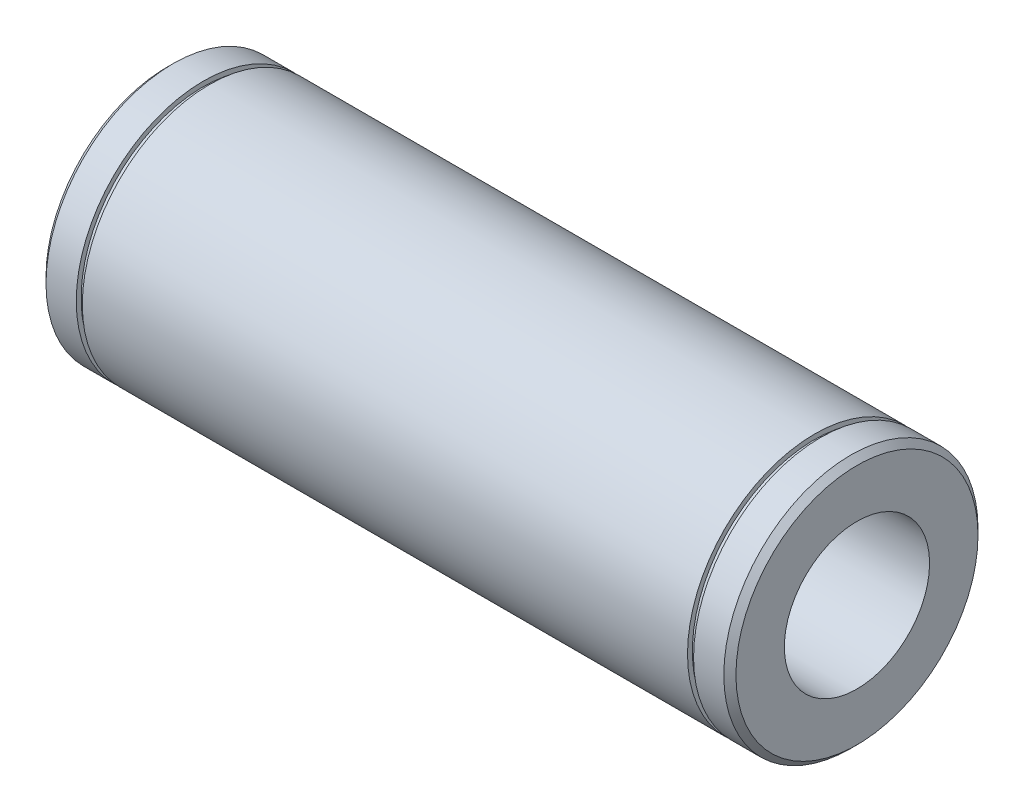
ISO-10303-21;
HEADER;
FILE_DESCRIPTION(('STEP AP214'),'2;1');
FILE_NAME('part.step','',(''),(''),'','','');
FILE_SCHEMA(('AUTOMOTIVE_DESIGN { 1 0 10303 214 1 1 1 1 }'));
ENDSEC;
DATA;
#1=APPLICATION_CONTEXT('core data for automotive mechanical design processes');
#2=APPLICATION_PROTOCOL_DEFINITION('international standard','automotive_design',2000,#1);
#3=PRODUCT_CONTEXT('',#1,'mechanical');
#4=PRODUCT('Part','Part','',(#3));
#5=PRODUCT_RELATED_PRODUCT_CATEGORY('part','',(#4));
#6=PRODUCT_DEFINITION_FORMATION('','',#4);
#7=PRODUCT_DEFINITION_CONTEXT('part definition',#1,'design');
#8=PRODUCT_DEFINITION('design','',#6,#7);
#9=PRODUCT_DEFINITION_SHAPE('','',#8);
#10=(LENGTH_UNIT() NAMED_UNIT(*) SI_UNIT(.MILLI.,.METRE.));
#11=(NAMED_UNIT(*) PLANE_ANGLE_UNIT() SI_UNIT($,.RADIAN.));
#12=(NAMED_UNIT(*) SI_UNIT($,.STERADIAN.) SOLID_ANGLE_UNIT());
#13=UNCERTAINTY_MEASURE_WITH_UNIT(LENGTH_MEASURE(1.E-05),#10,'distance_accuracy_value','');
#14=(GEOMETRIC_REPRESENTATION_CONTEXT(3) GLOBAL_UNCERTAINTY_ASSIGNED_CONTEXT((#13)) GLOBAL_UNIT_ASSIGNED_CONTEXT((#10,
#11,#12)) REPRESENTATION_CONTEXT('',''));
#15=CARTESIAN_POINT('',(0.,0.,0.));
#16=DIRECTION('',(0.,0.,1.));
#17=DIRECTION('',(1.,0.,0.));
#18=AXIS2_PLACEMENT_3D('',#15,#16,#17);
#19=CARTESIAN_POINT('',(-31.35,0.,0.));
#20=DIRECTION('',(1.,0.,0.));
#21=DIRECTION('',(0.,0.,-1.));
#22=AXIS2_PLACEMENT_3D('',#19,#20,#21);
#23=CYLINDRICAL_SURFACE('',#22,6.);
#24=CARTESIAN_POINT('',(28.5,0.,0.));
#25=DIRECTION('',(1.,0.,0.));
#26=DIRECTION('',(0.,0.,-1.));
#27=AXIS2_PLACEMENT_3D('',#24,#25,#26);
#28=CIRCLE('',#27,6.);
#29=CARTESIAN_POINT('',(28.5,0.,-6.));
#30=VERTEX_POINT('',#29);
#31=EDGE_CURVE('E67',#30,#30,#28,.F.);
#32=ORIENTED_EDGE('',*,*,#31,.F.);
#33=EDGE_LOOP('',(#32));
#34=FACE_BOUND('',#33,.T.);
#35=CARTESIAN_POINT('',(-28.5,0.,0.));
#36=DIRECTION('',(1.,0.,0.));
#37=DIRECTION('',(0.,0.,-1.));
#38=AXIS2_PLACEMENT_3D('',#35,#36,#37);
#39=CIRCLE('',#38,6.);
#40=CARTESIAN_POINT('',(-28.5,0.,-6.));
#41=VERTEX_POINT('',#40);
#42=EDGE_CURVE('E18',#41,#41,#39,.F.);
#43=ORIENTED_EDGE('',*,*,#42,.T.);
#44=EDGE_LOOP('',(#43));
#45=FACE_BOUND('',#44,.T.);
#46=ADVANCED_FACE('F15',(#34,#45),#23,.F.);
#47=CARTESIAN_POINT('',(-28.5,0.,0.));
#48=DIRECTION('',(1.,0.,0.));
#49=DIRECTION('',(0.,0.,-1.));
#50=AXIS2_PLACEMENT_3D('',#47,#48,#49);
#51=PLANE('',#50);
#52=ORIENTED_EDGE('',*,*,#42,.F.);
#53=EDGE_LOOP('',(#52));
#54=FACE_BOUND('',#53,.T.);
#55=CARTESIAN_POINT('',(-28.5,0.,0.));
#56=DIRECTION('',(1.,0.,0.));
#57=DIRECTION('',(0.,0.,-1.));
#58=AXIS2_PLACEMENT_3D('',#55,#56,#57);
#59=CIRCLE('',#58,10.);
#60=CARTESIAN_POINT('',(-28.5,0.,-10.));
#61=VERTEX_POINT('',#60);
#62=EDGE_CURVE('E64',#61,#61,#59,.T.);
#63=ORIENTED_EDGE('',*,*,#62,.F.);
#64=EDGE_LOOP('',(#63));
#65=FACE_BOUND('',#64,.T.);
#66=ADVANCED_FACE('F77',(#54,#65),#51,.F.);
#67=CARTESIAN_POINT('',(28.5,0.,0.));
#68=DIRECTION('',(1.,0.,0.));
#69=DIRECTION('',(0.,0.,-1.));
#70=AXIS2_PLACEMENT_3D('',#67,#68,#69);
#71=PLANE('',#70);
#72=ORIENTED_EDGE('',*,*,#31,.T.);
#73=EDGE_LOOP('',(#72));
#74=FACE_BOUND('',#73,.T.);
#75=CARTESIAN_POINT('',(28.5,0.,0.));
#76=DIRECTION('',(-1.,0.,0.));
#77=DIRECTION('',(0.,0.,1.));
#78=AXIS2_PLACEMENT_3D('',#75,#76,#77);
#79=CIRCLE('',#78,10.);
#80=CARTESIAN_POINT('',(28.5,0.,10.));
#81=VERTEX_POINT('',#80);
#82=EDGE_CURVE('E61',#81,#81,#79,.T.);
#83=ORIENTED_EDGE('',*,*,#82,.F.);
#84=EDGE_LOOP('',(#83));
#85=FACE_BOUND('',#84,.T.);
#86=ADVANCED_FACE('F80',(#74,#85),#71,.T.);
#87=CARTESIAN_POINT('',(-28.,0.,0.));
#88=DIRECTION('',(1.,0.,0.));
#89=DIRECTION('',(0.,0.,-1.));
#90=AXIS2_PLACEMENT_3D('',#87,#88,#89);
#91=CONICAL_SURFACE('',#90,10.5,0.785398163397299);
#92=CARTESIAN_POINT('',(-28.,0.,0.));
#93=DIRECTION('',(1.,0.,0.));
#94=DIRECTION('',(0.,0.,-1.));
#95=AXIS2_PLACEMENT_3D('',#92,#93,#94);
#96=CIRCLE('',#95,10.5);
#97=CARTESIAN_POINT('',(-28.,0.,-10.5));
#98=VERTEX_POINT('',#97);
#99=EDGE_CURVE('E35',#98,#98,#96,.T.);
#100=ORIENTED_EDGE('',*,*,#99,.F.);
#101=EDGE_LOOP('',(#100));
#102=FACE_BOUND('',#101,.T.);
#103=ORIENTED_EDGE('',*,*,#62,.T.);
#104=EDGE_LOOP('',(#103));
#105=FACE_BOUND('',#104,.T.);
#106=ADVANCED_FACE('F83',(#102,#105),#91,.T.);
#107=CARTESIAN_POINT('',(28.,0.,0.));
#108=DIRECTION('',(-1.,0.,0.));
#109=DIRECTION('',(0.,0.,1.));
#110=AXIS2_PLACEMENT_3D('',#107,#108,#109);
#111=CONICAL_SURFACE('',#110,10.5,0.785398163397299);
#112=ORIENTED_EDGE('',*,*,#82,.T.);
#113=EDGE_LOOP('',(#112));
#114=FACE_BOUND('',#113,.T.);
#115=CARTESIAN_POINT('',(28.,0.,0.));
#116=DIRECTION('',(1.,0.,0.));
#117=DIRECTION('',(0.,0.,-1.));
#118=AXIS2_PLACEMENT_3D('',#115,#116,#117);
#119=CIRCLE('',#118,10.5);
#120=CARTESIAN_POINT('',(28.,0.,-10.5));
#121=VERTEX_POINT('',#120);
#122=EDGE_CURVE('E60',#121,#121,#119,.F.);
#123=ORIENTED_EDGE('',*,*,#122,.F.);
#124=EDGE_LOOP('',(#123));
#125=FACE_BOUND('',#124,.T.);
#126=ADVANCED_FACE('F85',(#114,#125),#111,.T.);
#127=CARTESIAN_POINT('',(-31.35,0.,0.));
#128=DIRECTION('',(1.,0.,0.));
#129=DIRECTION('',(0.,0.,-1.));
#130=AXIS2_PLACEMENT_3D('',#127,#128,#129);
#131=CYLINDRICAL_SURFACE('',#130,10.5);
#132=CARTESIAN_POINT('',(-25.5,0.,0.));
#133=DIRECTION('',(1.,0.,0.));
#134=DIRECTION('',(0.,0.,-1.));
#135=AXIS2_PLACEMENT_3D('',#132,#133,#134);
#136=CIRCLE('',#135,10.5);
#137=CARTESIAN_POINT('',(-25.5,0.,-10.5));
#138=VERTEX_POINT('',#137);
#139=EDGE_CURVE('E56',#138,#138,#136,.T.);
#140=ORIENTED_EDGE('',*,*,#139,.F.);
#141=EDGE_LOOP('',(#140));
#142=FACE_BOUND('',#141,.T.);
#143=ORIENTED_EDGE('',*,*,#99,.T.);
#144=EDGE_LOOP('',(#143));
#145=FACE_BOUND('',#144,.T.);
#146=ADVANCED_FACE('F93',(#142,#145),#131,.T.);
#147=CARTESIAN_POINT('',(-31.35,0.,0.));
#148=DIRECTION('',(1.,0.,0.));
#149=DIRECTION('',(0.,0.,-1.));
#150=AXIS2_PLACEMENT_3D('',#147,#148,#149);
#151=CYLINDRICAL_SURFACE('',#150,10.5);
#152=ORIENTED_EDGE('',*,*,#122,.T.);
#153=EDGE_LOOP('',(#152));
#154=FACE_BOUND('',#153,.T.);
#155=CARTESIAN_POINT('',(25.5,0.,0.));
#156=DIRECTION('',(1.,0.,0.));
#157=DIRECTION('',(0.,0.,-1.));
#158=AXIS2_PLACEMENT_3D('',#155,#156,#157);
#159=CIRCLE('',#158,10.5);
#160=CARTESIAN_POINT('',(25.5,0.,-10.5));
#161=VERTEX_POINT('',#160);
#162=EDGE_CURVE('E52',#161,#161,#159,.T.);
#163=ORIENTED_EDGE('',*,*,#162,.T.);
#164=EDGE_LOOP('',(#163));
#165=FACE_BOUND('',#164,.T.);
#166=ADVANCED_FACE('F129',(#154,#165),#151,.T.);
#167=CARTESIAN_POINT('',(-25.5,0.,0.));
#168=DIRECTION('',(1.,0.,0.));
#169=DIRECTION('',(0.,0.,-1.));
#170=AXIS2_PLACEMENT_3D('',#167,#168,#169);
#171=PLANE('',#170);
#172=CARTESIAN_POINT('',(-25.5,0.,0.));
#173=DIRECTION('',(1.,0.,0.));
#174=DIRECTION('',(0.,0.,-1.));
#175=AXIS2_PLACEMENT_3D('',#172,#173,#174);
#176=CIRCLE('',#175,10.1);
#177=CARTESIAN_POINT('',(-25.5,0.,-10.1));
#178=VERTEX_POINT('',#177);
#179=EDGE_CURVE('E48',#178,#178,#176,.T.);
#180=ORIENTED_EDGE('',*,*,#179,.F.);
#181=EDGE_LOOP('',(#180));
#182=FACE_BOUND('',#181,.T.);
#183=ORIENTED_EDGE('',*,*,#139,.T.);
#184=EDGE_LOOP('',(#183));
#185=FACE_BOUND('',#184,.T.);
#186=ADVANCED_FACE('F125',(#182,#185),#171,.T.);
#187=CARTESIAN_POINT('',(25.5,0.,0.));
#188=DIRECTION('',(1.,0.,0.));
#189=DIRECTION('',(0.,0.,-1.));
#190=AXIS2_PLACEMENT_3D('',#187,#188,#189);
#191=PLANE('',#190);
#192=CARTESIAN_POINT('',(25.5,0.,0.));
#193=DIRECTION('',(1.,0.,0.));
#194=DIRECTION('',(0.,0.,-1.));
#195=AXIS2_PLACEMENT_3D('',#192,#193,#194);
#196=CIRCLE('',#195,10.1);
#197=CARTESIAN_POINT('',(25.5,0.,-10.1));
#198=VERTEX_POINT('',#197);
#199=EDGE_CURVE('E45',#198,#198,#196,.F.);
#200=ORIENTED_EDGE('',*,*,#199,.F.);
#201=EDGE_LOOP('',(#200));
#202=FACE_BOUND('',#201,.T.);
#203=ORIENTED_EDGE('',*,*,#162,.F.);
#204=EDGE_LOOP('',(#203));
#205=FACE_BOUND('',#204,.T.);
#206=ADVANCED_FACE('F121',(#202,#205),#191,.F.);
#207=CARTESIAN_POINT('',(-31.35,0.,0.));
#208=DIRECTION('',(1.,0.,0.));
#209=DIRECTION('',(0.,0.,-1.));
#210=AXIS2_PLACEMENT_3D('',#207,#208,#209);
#211=CYLINDRICAL_SURFACE('',#210,10.1);
#212=ORIENTED_EDGE('',*,*,#179,.T.);
#213=EDGE_LOOP('',(#212));
#214=FACE_BOUND('',#213,.T.);
#215=CARTESIAN_POINT('',(-25.,0.,0.));
#216=DIRECTION('',(1.,0.,0.));
#217=DIRECTION('',(0.,0.,-1.));
#218=AXIS2_PLACEMENT_3D('',#215,#216,#217);
#219=CIRCLE('',#218,10.1);
#220=CARTESIAN_POINT('',(-25.,0.,-10.1));
#221=VERTEX_POINT('',#220);
#222=EDGE_CURVE('E41',#221,#221,#219,.F.);
#223=ORIENTED_EDGE('',*,*,#222,.T.);
#224=EDGE_LOOP('',(#223));
#225=FACE_BOUND('',#224,.T.);
#226=ADVANCED_FACE('F117',(#214,#225),#211,.T.);
#227=CARTESIAN_POINT('',(-31.35,0.,0.));
#228=DIRECTION('',(1.,0.,0.));
#229=DIRECTION('',(0.,0.,-1.));
#230=AXIS2_PLACEMENT_3D('',#227,#228,#229);
#231=CYLINDRICAL_SURFACE('',#230,10.1);
#232=CARTESIAN_POINT('',(25.,0.,0.));
#233=DIRECTION('',(1.,0.,0.));
#234=DIRECTION('',(0.,0.,-1.));
#235=AXIS2_PLACEMENT_3D('',#232,#233,#234);
#236=CIRCLE('',#235,10.1);
#237=CARTESIAN_POINT('',(25.,0.,-10.1));
#238=VERTEX_POINT('',#237);
#239=EDGE_CURVE('E32',#238,#238,#236,.F.);
#240=ORIENTED_EDGE('',*,*,#239,.F.);
#241=EDGE_LOOP('',(#240));
#242=FACE_BOUND('',#241,.T.);
#243=ORIENTED_EDGE('',*,*,#199,.T.);
#244=EDGE_LOOP('',(#243));
#245=FACE_BOUND('',#244,.T.);
#246=ADVANCED_FACE('F114',(#242,#245),#231,.T.);
#247=CARTESIAN_POINT('',(-25.,0.,0.));
#248=DIRECTION('',(1.,0.,0.));
#249=DIRECTION('',(0.,0.,-1.));
#250=AXIS2_PLACEMENT_3D('',#247,#248,#249);
#251=PLANE('',#250);
#252=ORIENTED_EDGE('',*,*,#222,.F.);
#253=EDGE_LOOP('',(#252));
#254=FACE_BOUND('',#253,.T.);
#255=CARTESIAN_POINT('',(-25.,0.,0.));
#256=DIRECTION('',(1.,0.,0.));
#257=DIRECTION('',(0.,0.,-1.));
#258=AXIS2_PLACEMENT_3D('',#255,#256,#257);
#259=CIRCLE('',#258,10.5);
#260=CARTESIAN_POINT('',(-25.,0.,-10.5));
#261=VERTEX_POINT('',#260);
#262=EDGE_CURVE('E23',#261,#261,#259,.T.);
#263=ORIENTED_EDGE('',*,*,#262,.F.);
#264=EDGE_LOOP('',(#263));
#265=FACE_BOUND('',#264,.T.);
#266=ADVANCED_FACE('F107',(#254,#265),#251,.F.);
#267=CARTESIAN_POINT('',(25.,0.,0.));
#268=DIRECTION('',(1.,0.,0.));
#269=DIRECTION('',(0.,0.,-1.));
#270=AXIS2_PLACEMENT_3D('',#267,#268,#269);
#271=PLANE('',#270);
#272=ORIENTED_EDGE('',*,*,#239,.T.);
#273=EDGE_LOOP('',(#272));
#274=FACE_BOUND('',#273,.T.);
#275=CARTESIAN_POINT('',(25.,0.,0.));
#276=DIRECTION('',(1.,0.,0.));
#277=DIRECTION('',(0.,0.,-1.));
#278=AXIS2_PLACEMENT_3D('',#275,#276,#277);
#279=CIRCLE('',#278,10.5);
#280=CARTESIAN_POINT('',(25.,0.,-10.5));
#281=VERTEX_POINT('',#280);
#282=EDGE_CURVE('E10',#281,#281,#279,.F.);
#283=ORIENTED_EDGE('',*,*,#282,.F.);
#284=EDGE_LOOP('',(#283));
#285=FACE_BOUND('',#284,.T.);
#286=ADVANCED_FACE('F100',(#274,#285),#271,.T.);
#287=CARTESIAN_POINT('',(-31.35,0.,0.));
#288=DIRECTION('',(1.,0.,0.));
#289=DIRECTION('',(0.,0.,-1.));
#290=AXIS2_PLACEMENT_3D('',#287,#288,#289);
#291=CYLINDRICAL_SURFACE('',#290,10.5);
#292=ORIENTED_EDGE('',*,*,#282,.T.);
#293=EDGE_LOOP('',(#292));
#294=FACE_BOUND('',#293,.T.);
#295=ORIENTED_EDGE('',*,*,#262,.T.);
#296=EDGE_LOOP('',(#295));
#297=FACE_BOUND('',#296,.T.);
#298=ADVANCED_FACE('F98',(#294,#297),#291,.T.);
#299=CLOSED_SHELL('',(#46,#66,#86,#106,#126,#146,#166,#186,#206,#226,#246,#266,#286,#298));
#300=MANIFOLD_SOLID_BREP('B1',#299);
#301=ADVANCED_BREP_SHAPE_REPRESENTATION('',(#18,#300),#14);
#302=SHAPE_DEFINITION_REPRESENTATION(#9,#301);
ENDSEC;
END-ISO-10303-21;
